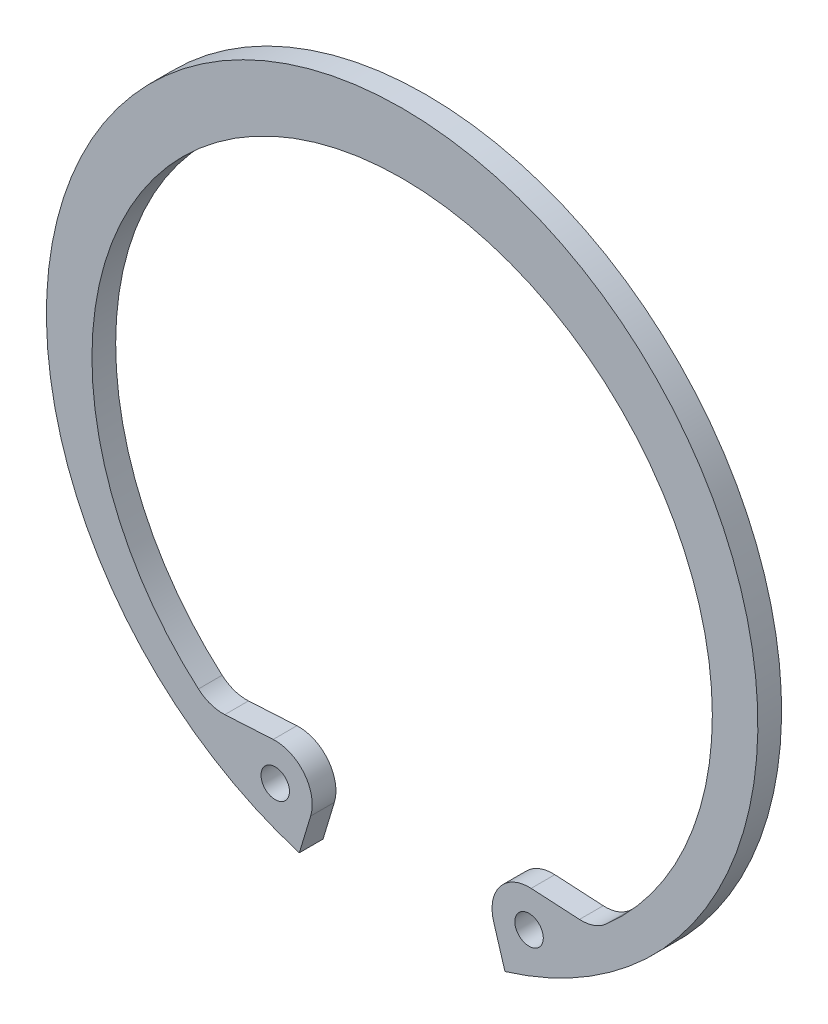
from build123d import *

# Parameters (mm, degrees)
ESQUISSE1_R          = 1.5
BASE_EXTRUSION_DEPTH = 2.5


with BuildPart() as part:
    # Esquisse1 → Base-Extrusion (new body)
    with BuildSketch(Plane.XY):
        with BuildLine():
            Line((9.645827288, -31.948521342), (10.838692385, -35.899481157))
            ThreePointArc((10.838692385, -35.899481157), (0, 37.5), (-10.838692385, -35.899481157))
            Line((-10.838692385, -35.899481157), (-9.645827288, -31.948521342))
            ThreePointArc((-9.645827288, -31.948521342), (-10.314531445, -28.409504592), (-13.597077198, -26.927378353))
            Line((-13.597077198, -26.927378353), (-18.696425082, -27.212476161))
            ThreePointArc((-18.696425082, -27.212476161), (-20.179073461, -27.007719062), (-21.475417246, -26.259611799))
            ThreePointArc((-21.475417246, -26.259611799), (0, 31.1), (21.475417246, -26.259611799))
            ThreePointArc((21.475417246, -26.259611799), (20.179073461, -27.007719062), (18.696425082, -27.212476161))
            Line((18.696425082, -27.212476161), (13.597077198, -26.927378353))
            ThreePointArc((13.597077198, -26.927378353), (10.314531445, -28.409504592), (9.645827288, -31.948521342))
        make_face()
        with Locations((13.379373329, -30.821297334)):
            Circle(ESQUISSE1_R, mode=Mode.SUBTRACT)
        with Locations(Location((-13.379373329, -30.821297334, 0), (0, 0, 180))):
            Circle(ESQUISSE1_R, mode=Mode.SUBTRACT)
    extrude(amount=BASE_EXTRUSION_DEPTH)


solid = part.part
